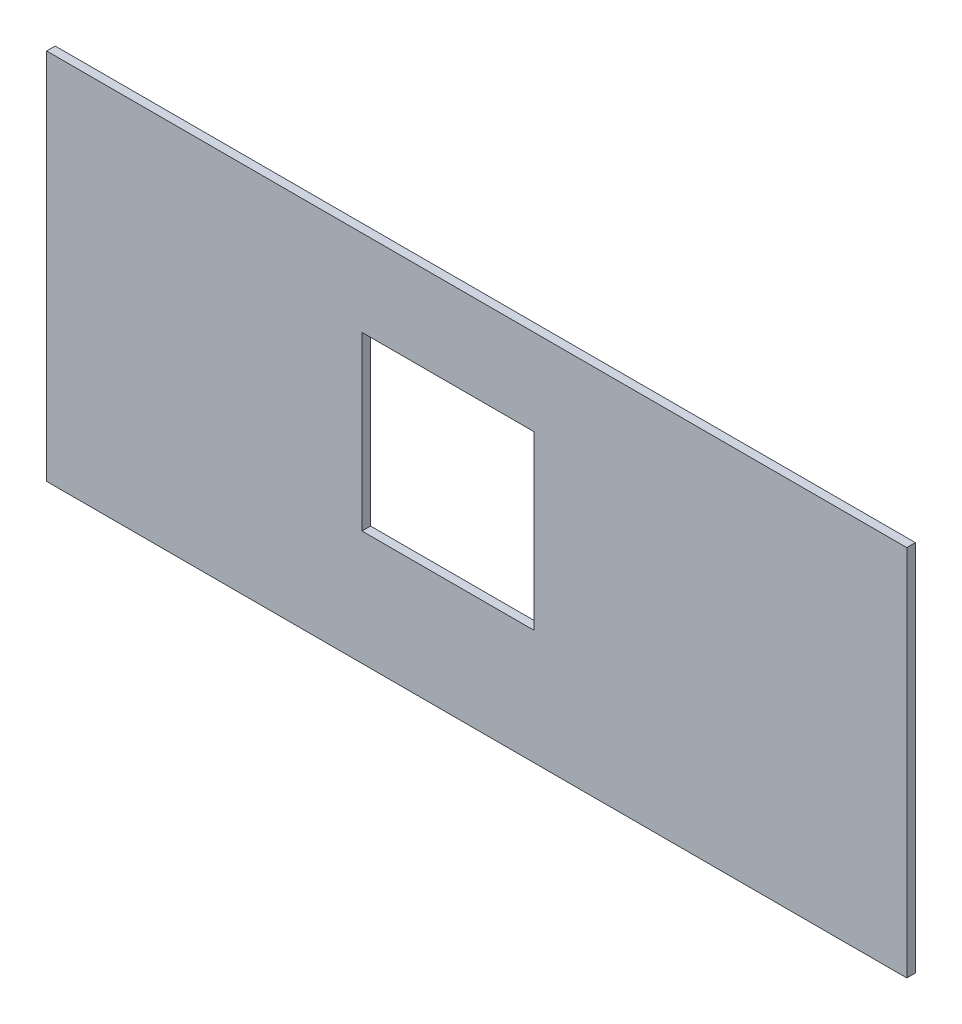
ISO-10303-21;
HEADER;
FILE_DESCRIPTION(('STEP AP214'),'2;1');
FILE_NAME('part.step','',(''),(''),'','','');
FILE_SCHEMA(('AUTOMOTIVE_DESIGN { 1 0 10303 214 1 1 1 1 }'));
ENDSEC;
DATA;
#1=APPLICATION_CONTEXT('core data for automotive mechanical design processes');
#2=APPLICATION_PROTOCOL_DEFINITION('international standard','automotive_design',2000,#1);
#3=PRODUCT_CONTEXT('',#1,'mechanical');
#4=PRODUCT('Part','Part','',(#3));
#5=PRODUCT_RELATED_PRODUCT_CATEGORY('part','',(#4));
#6=PRODUCT_DEFINITION_FORMATION('','',#4);
#7=PRODUCT_DEFINITION_CONTEXT('part definition',#1,'design');
#8=PRODUCT_DEFINITION('design','',#6,#7);
#9=PRODUCT_DEFINITION_SHAPE('','',#8);
#10=(LENGTH_UNIT() NAMED_UNIT(*) SI_UNIT(.MILLI.,.METRE.));
#11=(NAMED_UNIT(*) PLANE_ANGLE_UNIT() SI_UNIT($,.RADIAN.));
#12=(NAMED_UNIT(*) SI_UNIT($,.STERADIAN.) SOLID_ANGLE_UNIT());
#13=UNCERTAINTY_MEASURE_WITH_UNIT(LENGTH_MEASURE(1.E-05),#10,'distance_accuracy_value','');
#14=(GEOMETRIC_REPRESENTATION_CONTEXT(3) GLOBAL_UNCERTAINTY_ASSIGNED_CONTEXT((#13)) GLOBAL_UNIT_ASSIGNED_CONTEXT((#10,
#11,#12)) REPRESENTATION_CONTEXT('',''));
#15=CARTESIAN_POINT('',(0.,0.,0.));
#16=DIRECTION('',(0.,0.,1.));
#17=DIRECTION('',(1.,0.,0.));
#18=AXIS2_PLACEMENT_3D('',#15,#16,#17);
#19=CARTESIAN_POINT('',(0.,130.,3.));
#20=DIRECTION('',(0.,0.,-1.));
#21=DIRECTION('',(-1.,0.,0.));
#22=AXIS2_PLACEMENT_3D('',#19,#20,#21);
#23=PLANE('',#22);
#24=DIRECTION('',(0.,-1.,0.));
#25=VECTOR('',#24,1.);
#26=CARTESIAN_POINT('',(0.,0.,3.));
#27=LINE('',#26,#25);
#28=CARTESIAN_POINT('',(0.,130.,3.));
#29=VERTEX_POINT('',#28);
#30=CARTESIAN_POINT('',(0.,0.,3.));
#31=VERTEX_POINT('',#30);
#32=EDGE_CURVE('E135',#29,#31,#27,.T.);
#33=ORIENTED_EDGE('',*,*,#32,.T.);
#34=DIRECTION('',(1.,0.,0.));
#35=VECTOR('',#34,1.);
#36=CARTESIAN_POINT('',(0.,0.,3.));
#37=LINE('',#36,#35);
#38=CARTESIAN_POINT('',(300.,0.,3.));
#39=VERTEX_POINT('',#38);
#40=EDGE_CURVE('E138',#31,#39,#37,.T.);
#41=ORIENTED_EDGE('',*,*,#40,.T.);
#42=DIRECTION('',(0.,1.,0.));
#43=VECTOR('',#42,1.);
#44=CARTESIAN_POINT('',(300.,0.,3.));
#45=LINE('',#44,#43);
#46=CARTESIAN_POINT('',(300.,130.,3.));
#47=VERTEX_POINT('',#46);
#48=EDGE_CURVE('E140',#39,#47,#45,.T.);
#49=ORIENTED_EDGE('',*,*,#48,.T.);
#50=DIRECTION('',(-1.,0.,0.));
#51=VECTOR('',#50,1.);
#52=CARTESIAN_POINT('',(0.,130.,3.));
#53=LINE('',#52,#51);
#54=EDGE_CURVE('E142',#47,#29,#53,.T.);
#55=ORIENTED_EDGE('',*,*,#54,.T.);
#56=EDGE_LOOP('',(#33,#41,#49,#55));
#57=FACE_BOUND('',#56,.T.);
#58=DIRECTION('',(0.,-1.,0.));
#59=VECTOR('',#58,1.);
#60=CARTESIAN_POINT('',(110.,100.,3.));
#61=LINE('',#60,#59);
#62=CARTESIAN_POINT('',(110.,100.,3.));
#63=VERTEX_POINT('',#62);
#64=CARTESIAN_POINT('',(110.,40.,3.));
#65=VERTEX_POINT('',#64);
#66=EDGE_CURVE('E106',#63,#65,#61,.T.);
#67=ORIENTED_EDGE('',*,*,#66,.F.);
#68=DIRECTION('',(-1.,0.,0.));
#69=VECTOR('',#68,1.);
#70=CARTESIAN_POINT('',(110.,100.,3.));
#71=LINE('',#70,#69);
#72=CARTESIAN_POINT('',(170.,100.,3.));
#73=VERTEX_POINT('',#72);
#74=EDGE_CURVE('E121',#73,#63,#71,.T.);
#75=ORIENTED_EDGE('',*,*,#74,.F.);
#76=DIRECTION('',(0.,1.,0.));
#77=VECTOR('',#76,1.);
#78=CARTESIAN_POINT('',(170.,100.,3.));
#79=LINE('',#78,#77);
#80=CARTESIAN_POINT('',(170.,40.,3.));
#81=VERTEX_POINT('',#80);
#82=EDGE_CURVE('E119',#81,#73,#79,.T.);
#83=ORIENTED_EDGE('',*,*,#82,.F.);
#84=DIRECTION('',(1.,0.,0.));
#85=VECTOR('',#84,1.);
#86=CARTESIAN_POINT('',(110.,40.,3.));
#87=LINE('',#86,#85);
#88=EDGE_CURVE('E117',#65,#81,#87,.T.);
#89=ORIENTED_EDGE('',*,*,#88,.F.);
#90=EDGE_LOOP('',(#67,#75,#83,#89));
#91=FACE_BOUND('',#90,.T.);
#92=ADVANCED_FACE('F26',(#57,#91),#23,.F.);
#93=CARTESIAN_POINT('',(0.,130.,0.));
#94=DIRECTION('',(0.,0.,-1.));
#95=DIRECTION('',(-1.,0.,0.));
#96=AXIS2_PLACEMENT_3D('',#93,#94,#95);
#97=PLANE('',#96);
#98=DIRECTION('',(0.,-1.,0.));
#99=VECTOR('',#98,1.);
#100=CARTESIAN_POINT('',(0.,0.,0.));
#101=LINE('',#100,#99);
#102=CARTESIAN_POINT('',(0.,130.,0.));
#103=VERTEX_POINT('',#102);
#104=CARTESIAN_POINT('',(0.,0.,0.));
#105=VERTEX_POINT('',#104);
#106=EDGE_CURVE('E107',#103,#105,#101,.T.);
#107=ORIENTED_EDGE('',*,*,#106,.F.);
#108=DIRECTION('',(-1.,0.,0.));
#109=VECTOR('',#108,1.);
#110=CARTESIAN_POINT('',(0.,130.,0.));
#111=LINE('',#110,#109);
#112=CARTESIAN_POINT('',(300.,130.,0.));
#113=VERTEX_POINT('',#112);
#114=EDGE_CURVE('E133',#113,#103,#111,.T.);
#115=ORIENTED_EDGE('',*,*,#114,.F.);
#116=DIRECTION('',(0.,1.,0.));
#117=VECTOR('',#116,1.);
#118=CARTESIAN_POINT('',(300.,0.,0.));
#119=LINE('',#118,#117);
#120=CARTESIAN_POINT('',(300.,0.,0.));
#121=VERTEX_POINT('',#120);
#122=EDGE_CURVE('E131',#121,#113,#119,.T.);
#123=ORIENTED_EDGE('',*,*,#122,.F.);
#124=DIRECTION('',(1.,0.,0.));
#125=VECTOR('',#124,1.);
#126=CARTESIAN_POINT('',(0.,0.,0.));
#127=LINE('',#126,#125);
#128=EDGE_CURVE('E129',#105,#121,#127,.T.);
#129=ORIENTED_EDGE('',*,*,#128,.F.);
#130=EDGE_LOOP('',(#107,#115,#123,#129));
#131=FACE_BOUND('',#130,.T.);
#132=DIRECTION('',(-1.,0.,0.));
#133=VECTOR('',#132,1.);
#134=CARTESIAN_POINT('',(110.,100.,0.));
#135=LINE('',#134,#133);
#136=CARTESIAN_POINT('',(170.,100.,0.));
#137=VERTEX_POINT('',#136);
#138=CARTESIAN_POINT('',(110.,100.,0.));
#139=VERTEX_POINT('',#138);
#140=EDGE_CURVE('E111',#137,#139,#135,.T.);
#141=ORIENTED_EDGE('',*,*,#140,.T.);
#142=DIRECTION('',(0.,-1.,0.));
#143=VECTOR('',#142,1.);
#144=CARTESIAN_POINT('',(110.,100.,0.));
#145=LINE('',#144,#143);
#146=CARTESIAN_POINT('',(110.,40.,0.));
#147=VERTEX_POINT('',#146);
#148=EDGE_CURVE('E49',#139,#147,#145,.T.);
#149=ORIENTED_EDGE('',*,*,#148,.T.);
#150=DIRECTION('',(1.,0.,0.));
#151=VECTOR('',#150,1.);
#152=CARTESIAN_POINT('',(110.,40.,0.));
#153=LINE('',#152,#151);
#154=CARTESIAN_POINT('',(170.,40.,0.));
#155=VERTEX_POINT('',#154);
#156=EDGE_CURVE('E93',#147,#155,#153,.T.);
#157=ORIENTED_EDGE('',*,*,#156,.T.);
#158=DIRECTION('',(0.,1.,0.));
#159=VECTOR('',#158,1.);
#160=CARTESIAN_POINT('',(170.,100.,0.));
#161=LINE('',#160,#159);
#162=EDGE_CURVE('E102',#155,#137,#161,.T.);
#163=ORIENTED_EDGE('',*,*,#162,.T.);
#164=EDGE_LOOP('',(#141,#149,#157,#163));
#165=FACE_BOUND('',#164,.T.);
#166=ADVANCED_FACE('F110',(#131,#165),#97,.T.);
#167=CARTESIAN_POINT('',(0.,0.,3.));
#168=DIRECTION('',(1.,0.,0.));
#169=DIRECTION('',(0.,0.,-1.));
#170=AXIS2_PLACEMENT_3D('',#167,#168,#169);
#171=PLANE('',#170);
#172=ORIENTED_EDGE('',*,*,#106,.T.);
#173=DIRECTION('',(0.,0.,-1.));
#174=VECTOR('',#173,1.);
#175=CARTESIAN_POINT('',(0.,0.,3.));
#176=LINE('',#175,#174);
#177=EDGE_CURVE('E11',#31,#105,#176,.T.);
#178=ORIENTED_EDGE('',*,*,#177,.F.);
#179=ORIENTED_EDGE('',*,*,#32,.F.);
#180=DIRECTION('',(0.,0.,-1.));
#181=VECTOR('',#180,1.);
#182=CARTESIAN_POINT('',(0.,130.,3.));
#183=LINE('',#182,#181);
#184=EDGE_CURVE('E144',#29,#103,#183,.T.);
#185=ORIENTED_EDGE('',*,*,#184,.T.);
#186=EDGE_LOOP('',(#172,#178,#179,#185));
#187=FACE_BOUND('',#186,.T.);
#188=ADVANCED_FACE('F28',(#187),#171,.F.);
#189=CARTESIAN_POINT('',(0.,0.,3.));
#190=DIRECTION('',(0.,1.,0.));
#191=DIRECTION('',(0.,0.,1.));
#192=AXIS2_PLACEMENT_3D('',#189,#190,#191);
#193=PLANE('',#192);
#194=ORIENTED_EDGE('',*,*,#128,.T.);
#195=DIRECTION('',(0.,0.,-1.));
#196=VECTOR('',#195,1.);
#197=CARTESIAN_POINT('',(300.,0.,3.));
#198=LINE('',#197,#196);
#199=EDGE_CURVE('E34',#39,#121,#198,.T.);
#200=ORIENTED_EDGE('',*,*,#199,.F.);
#201=ORIENTED_EDGE('',*,*,#40,.F.);
#202=ORIENTED_EDGE('',*,*,#177,.T.);
#203=EDGE_LOOP('',(#194,#200,#201,#202));
#204=FACE_BOUND('',#203,.T.);
#205=ADVANCED_FACE('F169',(#204),#193,.F.);
#206=CARTESIAN_POINT('',(300.,0.,3.));
#207=DIRECTION('',(-1.,0.,0.));
#208=DIRECTION('',(0.,0.,1.));
#209=AXIS2_PLACEMENT_3D('',#206,#207,#208);
#210=PLANE('',#209);
#211=ORIENTED_EDGE('',*,*,#122,.T.);
#212=DIRECTION('',(0.,0.,-1.));
#213=VECTOR('',#212,1.);
#214=CARTESIAN_POINT('',(300.,130.,3.));
#215=LINE('',#214,#213);
#216=EDGE_CURVE('E147',#47,#113,#215,.T.);
#217=ORIENTED_EDGE('',*,*,#216,.F.);
#218=ORIENTED_EDGE('',*,*,#48,.F.);
#219=ORIENTED_EDGE('',*,*,#199,.T.);
#220=EDGE_LOOP('',(#211,#217,#218,#219));
#221=FACE_BOUND('',#220,.T.);
#222=ADVANCED_FACE('F154',(#221),#210,.F.);
#223=CARTESIAN_POINT('',(0.,130.,3.));
#224=DIRECTION('',(0.,-1.,0.));
#225=DIRECTION('',(0.,0.,-1.));
#226=AXIS2_PLACEMENT_3D('',#223,#224,#225);
#227=PLANE('',#226);
#228=ORIENTED_EDGE('',*,*,#114,.T.);
#229=ORIENTED_EDGE('',*,*,#184,.F.);
#230=ORIENTED_EDGE('',*,*,#54,.F.);
#231=ORIENTED_EDGE('',*,*,#216,.T.);
#232=EDGE_LOOP('',(#228,#229,#230,#231));
#233=FACE_BOUND('',#232,.T.);
#234=ADVANCED_FACE('F162',(#233),#227,.F.);
#235=CARTESIAN_POINT('',(110.,100.,3.));
#236=DIRECTION('',(1.,0.,0.));
#237=DIRECTION('',(0.,1.,0.));
#238=AXIS2_PLACEMENT_3D('',#235,#236,#237);
#239=PLANE('',#238);
#240=ORIENTED_EDGE('',*,*,#148,.F.);
#241=DIRECTION('',(0.,0.,-1.));
#242=VECTOR('',#241,1.);
#243=CARTESIAN_POINT('',(110.,100.,3.));
#244=LINE('',#243,#242);
#245=EDGE_CURVE('E123',#63,#139,#244,.T.);
#246=ORIENTED_EDGE('',*,*,#245,.F.);
#247=ORIENTED_EDGE('',*,*,#66,.T.);
#248=DIRECTION('',(0.,0.,-1.));
#249=VECTOR('',#248,1.);
#250=CARTESIAN_POINT('',(110.,40.,3.));
#251=LINE('',#250,#249);
#252=EDGE_CURVE('E95',#65,#147,#251,.T.);
#253=ORIENTED_EDGE('',*,*,#252,.T.);
#254=EDGE_LOOP('',(#240,#246,#247,#253));
#255=FACE_BOUND('',#254,.T.);
#256=ADVANCED_FACE('F104',(#255),#239,.T.);
#257=CARTESIAN_POINT('',(110.,40.,3.));
#258=DIRECTION('',(0.,1.,0.));
#259=DIRECTION('',(0.,0.,1.));
#260=AXIS2_PLACEMENT_3D('',#257,#258,#259);
#261=PLANE('',#260);
#262=ORIENTED_EDGE('',*,*,#156,.F.);
#263=ORIENTED_EDGE('',*,*,#252,.F.);
#264=ORIENTED_EDGE('',*,*,#88,.T.);
#265=DIRECTION('',(0.,0.,-1.));
#266=VECTOR('',#265,1.);
#267=CARTESIAN_POINT('',(170.,40.,3.));
#268=LINE('',#267,#266);
#269=EDGE_CURVE('E98',#81,#155,#268,.T.);
#270=ORIENTED_EDGE('',*,*,#269,.T.);
#271=EDGE_LOOP('',(#262,#263,#264,#270));
#272=FACE_BOUND('',#271,.T.);
#273=ADVANCED_FACE('F94',(#272),#261,.T.);
#274=CARTESIAN_POINT('',(170.,100.,3.));
#275=DIRECTION('',(-1.,0.,0.));
#276=DIRECTION('',(0.,0.,1.));
#277=AXIS2_PLACEMENT_3D('',#274,#275,#276);
#278=PLANE('',#277);
#279=ORIENTED_EDGE('',*,*,#162,.F.);
#280=ORIENTED_EDGE('',*,*,#269,.F.);
#281=ORIENTED_EDGE('',*,*,#82,.T.);
#282=DIRECTION('',(0.,0.,-1.));
#283=VECTOR('',#282,1.);
#284=CARTESIAN_POINT('',(170.,100.,3.));
#285=LINE('',#284,#283);
#286=EDGE_CURVE('E41',#73,#137,#285,.T.);
#287=ORIENTED_EDGE('',*,*,#286,.T.);
#288=EDGE_LOOP('',(#279,#280,#281,#287));
#289=FACE_BOUND('',#288,.T.);
#290=ADVANCED_FACE('F191',(#289),#278,.T.);
#291=CARTESIAN_POINT('',(110.,100.,3.));
#292=DIRECTION('',(0.,-1.,0.));
#293=DIRECTION('',(0.,0.,-1.));
#294=AXIS2_PLACEMENT_3D('',#291,#292,#293);
#295=PLANE('',#294);
#296=ORIENTED_EDGE('',*,*,#140,.F.);
#297=ORIENTED_EDGE('',*,*,#286,.F.);
#298=ORIENTED_EDGE('',*,*,#74,.T.);
#299=ORIENTED_EDGE('',*,*,#245,.T.);
#300=EDGE_LOOP('',(#296,#297,#298,#299));
#301=FACE_BOUND('',#300,.T.);
#302=ADVANCED_FACE('F196',(#301),#295,.T.);
#303=CLOSED_SHELL('',(#92,#166,#188,#205,#222,#234,#256,#273,#290,#302));
#304=MANIFOLD_SOLID_BREP('B2',#303);
#305=ADVANCED_BREP_SHAPE_REPRESENTATION('',(#18,#304),#14);
#306=SHAPE_DEFINITION_REPRESENTATION(#9,#305);
ENDSEC;
END-ISO-10303-21;
